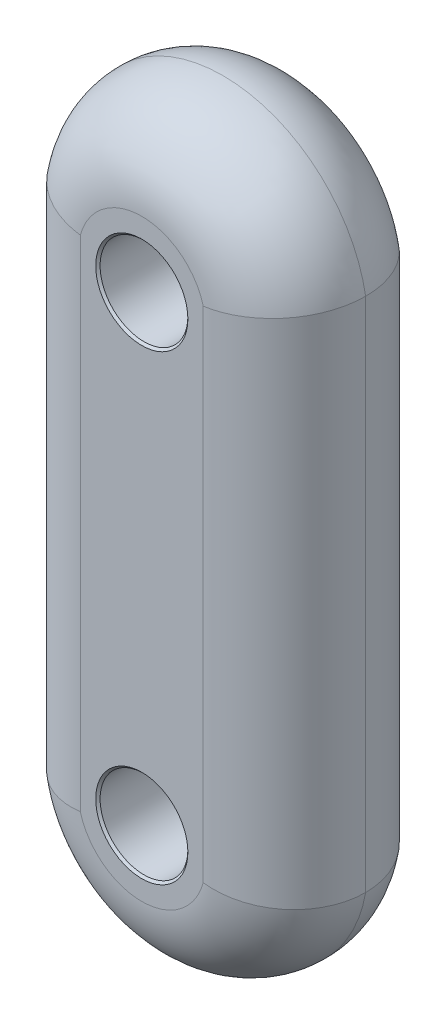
ISO-10303-21;
HEADER;
FILE_DESCRIPTION(('STEP AP214'),'2;1');
FILE_NAME('part.step','',(''),(''),'','','');
FILE_SCHEMA(('AUTOMOTIVE_DESIGN { 1 0 10303 214 1 1 1 1 }'));
ENDSEC;
DATA;
#1=APPLICATION_CONTEXT('core data for automotive mechanical design processes');
#2=APPLICATION_PROTOCOL_DEFINITION('international standard','automotive_design',2000,#1);
#3=PRODUCT_CONTEXT('',#1,'mechanical');
#4=PRODUCT('Part','Part','',(#3));
#5=PRODUCT_RELATED_PRODUCT_CATEGORY('part','',(#4));
#6=PRODUCT_DEFINITION_FORMATION('','',#4);
#7=PRODUCT_DEFINITION_CONTEXT('part definition',#1,'design');
#8=PRODUCT_DEFINITION('design','',#6,#7);
#9=PRODUCT_DEFINITION_SHAPE('','',#8);
#10=(LENGTH_UNIT() NAMED_UNIT(*) SI_UNIT(.MILLI.,.METRE.));
#11=(NAMED_UNIT(*) PLANE_ANGLE_UNIT() SI_UNIT($,.RADIAN.));
#12=(NAMED_UNIT(*) SI_UNIT($,.STERADIAN.) SOLID_ANGLE_UNIT());
#13=UNCERTAINTY_MEASURE_WITH_UNIT(LENGTH_MEASURE(1.E-05),#10,'distance_accuracy_value','');
#14=(GEOMETRIC_REPRESENTATION_CONTEXT(3) GLOBAL_UNCERTAINTY_ASSIGNED_CONTEXT((#13)) GLOBAL_UNIT_ASSIGNED_CONTEXT((#10,
#11,#12)) REPRESENTATION_CONTEXT('',''));
#15=CARTESIAN_POINT('',(0.,0.,0.));
#16=DIRECTION('',(0.,0.,1.));
#17=DIRECTION('',(1.,0.,0.));
#18=AXIS2_PLACEMENT_3D('',#15,#16,#17);
#19=CARTESIAN_POINT('',(0.,53.0945,18.5));
#20=DIRECTION('',(0.,0.,1.));
#21=DIRECTION('',(1.,0.,0.));
#22=AXIS2_PLACEMENT_3D('',#19,#20,#21);
#23=PLANE('',#22);
#24=CARTESIAN_POINT('',(0.,-52.5945,18.5));
#25=DIRECTION('',(0.,0.,1.));
#26=DIRECTION('',(1.,0.,0.));
#27=AXIS2_PLACEMENT_3D('',#24,#25,#26);
#28=CIRCLE('',#27,10.5);
#29=CARTESIAN_POINT('',(10.5,-52.5945,18.5));
#30=VERTEX_POINT('',#29);
#31=EDGE_CURVE('E231',#30,#30,#28,.F.);
#32=ORIENTED_EDGE('',*,*,#31,.T.);
#33=EDGE_LOOP('',(#32));
#34=FACE_BOUND('',#33,.T.);
#35=CARTESIAN_POINT('',(0.,52.5945,18.5));
#36=DIRECTION('',(0.,0.,1.));
#37=DIRECTION('',(1.,0.,0.));
#38=AXIS2_PLACEMENT_3D('',#35,#36,#37);
#39=CIRCLE('',#38,10.5);
#40=CARTESIAN_POINT('',(10.5,52.5945,18.5));
#41=VERTEX_POINT('',#40);
#42=EDGE_CURVE('E226',#41,#41,#39,.F.);
#43=ORIENTED_EDGE('',*,*,#42,.T.);
#44=EDGE_LOOP('',(#43));
#45=FACE_BOUND('',#44,.T.);
#46=CARTESIAN_POINT('',(0.,-53.0945,18.5));
#47=DIRECTION('',(0.,0.,1.));
#48=DIRECTION('',(1.,0.,0.));
#49=AXIS2_PLACEMENT_3D('',#46,#47,#48);
#50=CIRCLE('',#49,14.5);
#51=CARTESIAN_POINT('',(-14.,-56.8694172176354,18.5));
#52=VERTEX_POINT('',#51);
#53=CARTESIAN_POINT('',(14.,-56.8694172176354,18.5));
#54=VERTEX_POINT('',#53);
#55=EDGE_CURVE('E47',#52,#54,#50,.T.);
#56=ORIENTED_EDGE('',*,*,#55,.T.);
#57=DIRECTION('',(0.,1.,0.));
#58=VECTOR('',#57,1.);
#59=CARTESIAN_POINT('',(14.,58.8172615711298,18.5));
#60=LINE('',#59,#58);
#61=CARTESIAN_POINT('',(14.,56.8694172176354,18.5));
#62=VERTEX_POINT('',#61);
#63=EDGE_CURVE('E95',#54,#62,#60,.T.);
#64=ORIENTED_EDGE('',*,*,#63,.T.);
#65=CARTESIAN_POINT('',(0.,53.0945,18.5));
#66=DIRECTION('',(0.,0.,1.));
#67=DIRECTION('',(1.,0.,0.));
#68=AXIS2_PLACEMENT_3D('',#65,#66,#67);
#69=CIRCLE('',#68,14.5);
#70=CARTESIAN_POINT('',(-14.,56.8694172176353,18.5));
#71=VERTEX_POINT('',#70);
#72=EDGE_CURVE('E91',#62,#71,#69,.T.);
#73=ORIENTED_EDGE('',*,*,#72,.T.);
#74=DIRECTION('',(0.,-1.,0.));
#75=VECTOR('',#74,1.);
#76=CARTESIAN_POINT('',(-14.,-58.8172615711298,18.5));
#77=LINE('',#76,#75);
#78=EDGE_CURVE('E94',#71,#52,#77,.T.);
#79=ORIENTED_EDGE('',*,*,#78,.T.);
#80=EDGE_LOOP('',(#56,#64,#73,#79));
#81=FACE_BOUND('',#80,.T.);
#82=ADVANCED_FACE('F30',(#34,#45,#81),#23,.T.);
#83=CARTESIAN_POINT('',(0.,53.0945,-18.5));
#84=DIRECTION('',(0.,0.,1.));
#85=DIRECTION('',(1.,0.,0.));
#86=AXIS2_PLACEMENT_3D('',#83,#84,#85);
#87=PLANE('',#86);
#88=CARTESIAN_POINT('',(0.,-52.5945,-18.5));
#89=DIRECTION('',(0.,0.,1.));
#90=DIRECTION('',(1.,0.,0.));
#91=AXIS2_PLACEMENT_3D('',#88,#89,#90);
#92=CIRCLE('',#91,10.5);
#93=CARTESIAN_POINT('',(10.5,-52.5945,-18.5));
#94=VERTEX_POINT('',#93);
#95=EDGE_CURVE('E236',#94,#94,#92,.T.);
#96=ORIENTED_EDGE('',*,*,#95,.T.);
#97=EDGE_LOOP('',(#96));
#98=FACE_BOUND('',#97,.T.);
#99=CARTESIAN_POINT('',(0.,52.5945,-18.5));
#100=DIRECTION('',(0.,0.,1.));
#101=DIRECTION('',(1.,0.,0.));
#102=AXIS2_PLACEMENT_3D('',#99,#100,#101);
#103=CIRCLE('',#102,10.5);
#104=CARTESIAN_POINT('',(10.5,52.5945,-18.5));
#105=VERTEX_POINT('',#104);
#106=EDGE_CURVE('E233',#105,#105,#103,.T.);
#107=ORIENTED_EDGE('',*,*,#106,.T.);
#108=EDGE_LOOP('',(#107));
#109=FACE_BOUND('',#108,.T.);
#110=CARTESIAN_POINT('',(0.,-53.0945,-18.5));
#111=DIRECTION('',(0.,0.,1.));
#112=DIRECTION('',(1.,0.,0.));
#113=AXIS2_PLACEMENT_3D('',#110,#111,#112);
#114=CIRCLE('',#113,14.5);
#115=CARTESIAN_POINT('',(14.,-56.8694172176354,-18.5));
#116=VERTEX_POINT('',#115);
#117=CARTESIAN_POINT('',(-14.,-56.8694172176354,-18.5));
#118=VERTEX_POINT('',#117);
#119=EDGE_CURVE('E247',#116,#118,#114,.F.);
#120=ORIENTED_EDGE('',*,*,#119,.T.);
#121=DIRECTION('',(0.,-1.,0.));
#122=VECTOR('',#121,1.);
#123=CARTESIAN_POINT('',(-14.,53.0945,-18.5));
#124=LINE('',#123,#122);
#125=CARTESIAN_POINT('',(-14.,56.8694172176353,-18.5));
#126=VERTEX_POINT('',#125);
#127=EDGE_CURVE('E96',#118,#126,#124,.F.);
#128=ORIENTED_EDGE('',*,*,#127,.T.);
#129=CARTESIAN_POINT('',(0.,53.0945,-18.5));
#130=DIRECTION('',(0.,0.,1.));
#131=DIRECTION('',(1.,0.,0.));
#132=AXIS2_PLACEMENT_3D('',#129,#130,#131);
#133=CIRCLE('',#132,14.5);
#134=CARTESIAN_POINT('',(14.,56.8694172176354,-18.5));
#135=VERTEX_POINT('',#134);
#136=EDGE_CURVE('E358',#126,#135,#133,.F.);
#137=ORIENTED_EDGE('',*,*,#136,.T.);
#138=DIRECTION('',(0.,1.,0.));
#139=VECTOR('',#138,1.);
#140=CARTESIAN_POINT('',(14.,53.0945,-18.5));
#141=LINE('',#140,#139);
#142=EDGE_CURVE('E249',#135,#116,#141,.F.);
#143=ORIENTED_EDGE('',*,*,#142,.T.);
#144=EDGE_LOOP('',(#120,#128,#137,#143));
#145=FACE_BOUND('',#144,.T.);
#146=ADVANCED_FACE('F183',(#98,#109,#145),#87,.F.);
#147=CARTESIAN_POINT('',(14.,53.0945,0.));
#148=DIRECTION('',(0.,-1.,0.));
#149=DIRECTION('',(1.,0.,0.));
#150=AXIS2_PLACEMENT_3D('',#147,#148,#149);
#151=CYLINDRICAL_SURFACE('',#150,18.5);
#152=CARTESIAN_POINT('',(32.5,58.8172615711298,0.));
#153=CARTESIAN_POINT('',(32.5000003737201,58.8172614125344,0.259394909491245));
#154=CARTESIAN_POINT('',(32.4945437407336,58.8167848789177,0.518760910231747));
#155=CARTESIAN_POINT('',(32.4727327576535,58.8148788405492,1.03702451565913));
#156=CARTESIAN_POINT('',(32.4563786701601,58.813449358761,1.29592213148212));
#157=CARTESIAN_POINT('',(32.3910057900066,58.8077321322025,2.07117876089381));
#158=CARTESIAN_POINT('',(32.3256763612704,58.8020156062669,2.58623903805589));
#159=CARTESIAN_POINT('',(32.1520434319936,58.7867843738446,3.6085941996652));
#160=CARTESIAN_POINT('',(32.0437733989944,58.7772726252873,4.11589481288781));
#161=CARTESIAN_POINT('',(31.8497903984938,58.7601705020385,4.86848529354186));
#162=CARTESIAN_POINT('',(31.7798628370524,58.7539970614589,5.11796559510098));
#163=CARTESIAN_POINT('',(31.6295846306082,58.7407048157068,5.61381105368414));
#164=CARTESIAN_POINT('',(31.5492313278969,58.7335857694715,5.86017539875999));
#165=CARTESIAN_POINT('',(31.2927168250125,58.7108109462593,6.59396908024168));
#166=CARTESIAN_POINT('',(31.101114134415,58.6937386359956,7.07604824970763));
#167=CARTESIAN_POINT('',(30.6781702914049,58.6558423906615,8.0222941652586));
#168=CARTESIAN_POINT('',(30.4468290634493,58.6350184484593,8.48646087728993));
#169=CARTESIAN_POINT('',(30.0713589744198,58.6009949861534,9.166709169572));
#170=CARTESIAN_POINT('',(29.941448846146,58.58918828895,9.39080721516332));
#171=CARTESIAN_POINT('',(29.6723973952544,58.5646506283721,9.83325910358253));
#172=CARTESIAN_POINT('',(29.5332584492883,58.551919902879,10.0516144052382));
#173=CARTESIAN_POINT('',(29.1022885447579,58.5123395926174,10.6976056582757));
#174=CARTESIAN_POINT('',(28.7968800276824,58.4840996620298,11.1162113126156));
#175=CARTESIAN_POINT('',(28.1518051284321,58.423919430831,11.9266537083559));
#176=CARTESIAN_POINT('',(27.8120951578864,58.3919744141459,12.3184553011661));
#177=CARTESIAN_POINT('',(27.1011731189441,58.3244439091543,13.0720151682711));
#178=CARTESIAN_POINT('',(26.7299608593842,58.2888583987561,13.4337732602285));
#179=CARTESIAN_POINT('',(25.9585418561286,58.214064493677,14.1248521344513));
#180=CARTESIAN_POINT('',(25.558326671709,58.1748550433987,14.4541634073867));
#181=CARTESIAN_POINT('',(24.9386683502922,58.1133731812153,14.9218822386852));
#182=CARTESIAN_POINT('',(24.7288843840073,58.0924337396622,15.0734192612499));
#183=CARTESIAN_POINT('',(24.3031537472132,58.0496600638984,15.3675625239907));
#184=CARTESIAN_POINT('',(24.0872055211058,58.0278256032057,15.5101664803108));
#185=CARTESIAN_POINT('',(23.4292619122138,57.9608396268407,15.9250880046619));
#186=CARTESIAN_POINT('',(22.9785255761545,57.9143397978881,16.1834903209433));
#187=CARTESIAN_POINT('',(22.0572254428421,57.8177992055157,16.6613446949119));
#188=CARTESIAN_POINT('',(21.5866616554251,57.7677584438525,16.8807967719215));
#189=CARTESIAN_POINT('',(20.868687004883,57.6900801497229,17.1795913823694));
#190=CARTESIAN_POINT('',(20.6273611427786,57.6637534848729,17.274119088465));
#191=CARTESIAN_POINT('',(20.1411023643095,57.610230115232,17.4529069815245));
#192=CARTESIAN_POINT('',(19.8961703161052,57.5830336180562,17.5371695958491));
#193=CARTESIAN_POINT('',(19.1565912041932,57.5001378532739,17.7743477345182));
#194=CARTESIAN_POINT('',(18.6569845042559,57.4431132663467,17.9117270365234));
#195=CARTESIAN_POINT('',(17.8162756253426,57.3451251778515,18.1053982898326));
#196=CARTESIAN_POINT('',(17.4776980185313,57.3051248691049,18.1734640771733));
#197=CARTESIAN_POINT('',(16.7974413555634,57.2235561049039,18.2905267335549));
#198=CARTESIAN_POINT('',(16.4557625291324,57.1819877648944,18.3395250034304));
#199=CARTESIAN_POINT('',(15.7709511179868,57.0973414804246,18.4182618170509));
#200=CARTESIAN_POINT('',(15.4278216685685,57.0542660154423,18.4480305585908));
#201=CARTESIAN_POINT('',(14.7406958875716,56.9665304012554,18.4883679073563));
#202=CARTESIAN_POINT('',(14.3966998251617,56.9218706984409,18.4989418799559));
#203=CARTESIAN_POINT('',(14.0352354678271,56.8740821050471,18.4999748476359));
#204=CARTESIAN_POINT('',(14.0176174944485,56.8717507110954,18.5000000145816));
#205=CARTESIAN_POINT('',(14.,56.8694172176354,18.5));
#206=B_SPLINE_CURVE_WITH_KNOTS('',3,(#152,#153,#154,#155,#156,#157,#158,#159,#160,#161,#162,
#163,#164,#165,#166,#167,#168,#169,#170,#171,#172,#173,#174,#175,#176,#177,#178,#179,#180,#181,
#182,#183,#184,#185,#186,#187,#188,#189,#190,#191,#192,#193,#194,#195,#196,#197,#198,#199,#200,
#201,#202,#203,#204,#205),.UNSPECIFIED.,.F.,.F.,(4,2,2,2,2,2,2,2,2,2,2,2,2,2,2,2,2,2,2,2,2,2,2,
2,2,2,4),(0.,0.778069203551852,1.55611965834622,3.11180946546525,4.66628915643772,
5.44359374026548,6.22109686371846,7.7762600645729,9.33142622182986,10.1091214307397,
10.8866171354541,12.4414568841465,13.9982979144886,15.5551483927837,17.1124537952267,
17.8911675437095,18.6700795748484,20.2330070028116,21.7959336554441,22.5772673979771,
23.3584160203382,24.9201381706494,25.9626534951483,27.005092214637,28.0458898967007,
29.0863966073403,29.139711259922),.UNSPECIFIED.);
#207=CARTESIAN_POINT('',(32.5,58.8172615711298,0.));
#208=VERTEX_POINT('',#207);
#209=EDGE_CURVE('E70',#62,#208,#206,.F.);
#210=ORIENTED_EDGE('',*,*,#209,.F.);
#211=ORIENTED_EDGE('',*,*,#63,.F.);
#212=CARTESIAN_POINT('',(32.5,-58.8172615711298,0.));
#213=CARTESIAN_POINT('',(32.5000003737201,-58.8172614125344,0.259394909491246));
#214=CARTESIAN_POINT('',(32.4945437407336,-58.8167848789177,0.518760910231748));
#215=CARTESIAN_POINT('',(32.4727327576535,-58.8148788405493,1.03702451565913));
#216=CARTESIAN_POINT('',(32.4563786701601,-58.8134493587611,1.29592213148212));
#217=CARTESIAN_POINT('',(32.3910057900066,-58.8077321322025,2.07117876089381));
#218=CARTESIAN_POINT('',(32.3256763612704,-58.802015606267,2.5862390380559));
#219=CARTESIAN_POINT('',(32.1520434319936,-58.7867843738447,3.60859419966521));
#220=CARTESIAN_POINT('',(32.0437733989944,-58.7772726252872,4.11589481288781));
#221=CARTESIAN_POINT('',(31.8497903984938,-58.7601705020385,4.86848529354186));
#222=CARTESIAN_POINT('',(31.7798628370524,-58.7539970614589,5.11796559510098));
#223=CARTESIAN_POINT('',(31.6295846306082,-58.7407048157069,5.61381105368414));
#224=CARTESIAN_POINT('',(31.5492313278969,-58.7335857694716,5.86017539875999));
#225=CARTESIAN_POINT('',(31.2927168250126,-58.7108109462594,6.59396908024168));
#226=CARTESIAN_POINT('',(31.101114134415,-58.6937386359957,7.07604824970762));
#227=CARTESIAN_POINT('',(30.6781702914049,-58.6558423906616,8.02229416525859));
#228=CARTESIAN_POINT('',(30.4468290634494,-58.6350184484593,8.48646087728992));
#229=CARTESIAN_POINT('',(30.0713589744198,-58.6009949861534,9.16670916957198));
#230=CARTESIAN_POINT('',(29.9414488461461,-58.5891882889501,9.39080721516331));
#231=CARTESIAN_POINT('',(29.6723973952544,-58.5646506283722,9.83325910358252));
#232=CARTESIAN_POINT('',(29.5332584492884,-58.551919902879,10.0516144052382));
#233=CARTESIAN_POINT('',(29.1022885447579,-58.5123395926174,10.6976056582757));
#234=CARTESIAN_POINT('',(28.7968800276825,-58.4840996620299,11.1162113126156));
#235=CARTESIAN_POINT('',(28.1518051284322,-58.423919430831,11.9266537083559));
#236=CARTESIAN_POINT('',(27.8120951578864,-58.391974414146,12.3184553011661));
#237=CARTESIAN_POINT('',(27.101173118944,-58.3244439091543,13.0720151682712));
#238=CARTESIAN_POINT('',(26.7299608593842,-58.2888583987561,13.4337732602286));
#239=CARTESIAN_POINT('',(25.9585418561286,-58.214064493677,14.1248521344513));
#240=CARTESIAN_POINT('',(25.558326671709,-58.1748550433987,14.4541634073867));
#241=CARTESIAN_POINT('',(24.9386683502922,-58.1133731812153,14.9218822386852));
#242=CARTESIAN_POINT('',(24.7288843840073,-58.0924337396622,15.0734192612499));
#243=CARTESIAN_POINT('',(24.3031537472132,-58.0496600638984,15.3675625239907));
#244=CARTESIAN_POINT('',(24.0872055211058,-58.0278256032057,15.5101664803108));
#245=CARTESIAN_POINT('',(23.4292619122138,-57.9608396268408,15.9250880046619));
#246=CARTESIAN_POINT('',(22.9785255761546,-57.9143397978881,16.1834903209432));
#247=CARTESIAN_POINT('',(22.0572254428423,-57.8177992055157,16.6613446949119));
#248=CARTESIAN_POINT('',(21.5866616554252,-57.7677584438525,16.8807967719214));
#249=CARTESIAN_POINT('',(20.8686870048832,-57.690080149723,17.1795913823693));
#250=CARTESIAN_POINT('',(20.6273611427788,-57.663753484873,17.274119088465));
#251=CARTESIAN_POINT('',(20.1411023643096,-57.610230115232,17.4529069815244));
#252=CARTESIAN_POINT('',(19.8961703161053,-57.5830336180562,17.537169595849));
#253=CARTESIAN_POINT('',(19.1565912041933,-57.5001378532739,17.7743477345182));
#254=CARTESIAN_POINT('',(18.656984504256,-57.4431132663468,17.9117270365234));
#255=CARTESIAN_POINT('',(17.8162756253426,-57.3451251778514,18.1053982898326));
#256=CARTESIAN_POINT('',(17.4776980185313,-57.3051248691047,18.1734640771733));
#257=CARTESIAN_POINT('',(16.7974413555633,-57.2235561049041,18.2905267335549));
#258=CARTESIAN_POINT('',(16.4557625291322,-57.1819877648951,18.3395250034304));
#259=CARTESIAN_POINT('',(15.7709511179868,-57.0973414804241,18.4182618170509));
#260=CARTESIAN_POINT('',(15.4278216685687,-57.0542660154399,18.4480305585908));
#261=CARTESIAN_POINT('',(14.7406958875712,-56.9665304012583,18.4883679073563));
#262=CARTESIAN_POINT('',(14.3966998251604,-56.9218706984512,18.4989418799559));
#263=CARTESIAN_POINT('',(14.035235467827,-56.8740821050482,18.4999748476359));
#264=CARTESIAN_POINT('',(14.0176174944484,-56.8717507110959,18.5000000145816));
#265=CARTESIAN_POINT('',(14.,-56.8694172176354,18.5));
#266=B_SPLINE_CURVE_WITH_KNOTS('',3,(#212,#213,#214,#215,#216,#217,#218,#219,#220,#221,#222,
#223,#224,#225,#226,#227,#228,#229,#230,#231,#232,#233,#234,#235,#236,#237,#238,#239,#240,#241,
#242,#243,#244,#245,#246,#247,#248,#249,#250,#251,#252,#253,#254,#255,#256,#257,#258,#259,#260,
#261,#262,#263,#264,#265),.UNSPECIFIED.,.F.,.F.,(4,2,2,2,2,2,2,2,2,2,2,2,2,2,2,2,2,2,2,2,2,2,2,
2,2,2,4),(0.,0.778069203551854,1.55611965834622,3.11180946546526,4.66628915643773,
5.44359374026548,6.22109686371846,7.77626006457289,9.33142622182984,10.1091214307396,
10.8866171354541,12.4414568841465,13.9982979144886,15.5551483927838,17.1124537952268,
17.8911675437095,18.6700795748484,20.2330070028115,21.7959336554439,22.577267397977,
23.3584160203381,24.9201381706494,25.9626534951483,27.0050922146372,28.0458898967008,
29.0863966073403,29.139711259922),.UNSPECIFIED.);
#267=CARTESIAN_POINT('',(32.5,-58.8172615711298,0.));
#268=VERTEX_POINT('',#267);
#269=EDGE_CURVE('E63',#268,#54,#266,.T.);
#270=ORIENTED_EDGE('',*,*,#269,.F.);
#271=DIRECTION('',(0.,1.,0.));
#272=VECTOR('',#271,1.);
#273=CARTESIAN_POINT('',(32.5,-58.8172615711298,0.));
#274=LINE('',#273,#272);
#275=EDGE_CURVE('E166',#208,#268,#274,.F.);
#276=ORIENTED_EDGE('',*,*,#275,.F.);
#277=EDGE_LOOP('',(#210,#211,#270,#276));
#278=FACE_BOUND('',#277,.T.);
#279=ADVANCED_FACE('F179',(#278),#151,.T.);
#280=CARTESIAN_POINT('',(0.,53.0945,0.));
#281=DIRECTION('',(0.,0.,1.));
#282=DIRECTION('',(1.,0.,0.));
#283=AXIS2_PLACEMENT_3D('',#280,#281,#282);
#284=DEGENERATE_TOROIDAL_SURFACE('',#283,14.5,18.5,.T.);
#285=ORIENTED_EDGE('',*,*,#72,.F.);
#286=ORIENTED_EDGE('',*,*,#209,.T.);
#287=CARTESIAN_POINT('',(0.,53.0945,0.));
#288=DIRECTION('',(0.,0.,1.));
#289=DIRECTION('',(1.,0.,0.));
#290=AXIS2_PLACEMENT_3D('',#287,#288,#289);
#291=CIRCLE('',#290,33.);
#292=CARTESIAN_POINT('',(-32.5,58.8172615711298,0.));
#293=VERTEX_POINT('',#292);
#294=EDGE_CURVE('E102',#293,#208,#291,.F.);
#295=ORIENTED_EDGE('',*,*,#294,.F.);
#296=CARTESIAN_POINT('',(-32.5,58.8172615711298,0.));
#297=CARTESIAN_POINT('',(-32.5000003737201,58.8172614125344,0.259394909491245));
#298=CARTESIAN_POINT('',(-32.4945437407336,58.8167848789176,0.518760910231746));
#299=CARTESIAN_POINT('',(-32.4727327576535,58.8148788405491,1.03702451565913));
#300=CARTESIAN_POINT('',(-32.4563786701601,58.8134493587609,1.29592213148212));
#301=CARTESIAN_POINT('',(-32.3910057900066,58.8077321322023,2.07117876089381));
#302=CARTESIAN_POINT('',(-32.3256763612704,58.8020156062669,2.5862390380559));
#303=CARTESIAN_POINT('',(-32.1520434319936,58.7867843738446,3.6085941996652));
#304=CARTESIAN_POINT('',(-32.0437733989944,58.7772726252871,4.11589481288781));
#305=CARTESIAN_POINT('',(-31.8497903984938,58.7601705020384,4.86848529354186));
#306=CARTESIAN_POINT('',(-31.7798628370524,58.7539970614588,5.11796559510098));
#307=CARTESIAN_POINT('',(-31.6295846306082,58.7407048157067,5.61381105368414));
#308=CARTESIAN_POINT('',(-31.5492313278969,58.7335857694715,5.86017539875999));
#309=CARTESIAN_POINT('',(-31.2927168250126,58.7108109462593,6.59396908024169));
#310=CARTESIAN_POINT('',(-31.101114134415,58.6937386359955,7.07604824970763));
#311=CARTESIAN_POINT('',(-30.6781702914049,58.6558423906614,8.0222941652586));
#312=CARTESIAN_POINT('',(-30.4468290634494,58.6350184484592,8.48646087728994));
#313=CARTESIAN_POINT('',(-30.0713589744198,58.6009949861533,9.166709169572));
#314=CARTESIAN_POINT('',(-29.9414488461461,58.5891882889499,9.39080721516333));
#315=CARTESIAN_POINT('',(-29.6723973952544,58.564650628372,9.83325910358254));
#316=CARTESIAN_POINT('',(-29.5332584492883,58.5519199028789,10.0516144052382));
#317=CARTESIAN_POINT('',(-29.1022885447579,58.5123395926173,10.6976056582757));
#318=CARTESIAN_POINT('',(-28.7968800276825,58.4840996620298,11.1162113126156));
#319=CARTESIAN_POINT('',(-28.1518051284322,58.4239194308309,11.9266537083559));
#320=CARTESIAN_POINT('',(-27.8120951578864,58.3919744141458,12.3184553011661));
#321=CARTESIAN_POINT('',(-27.1011731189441,58.3244439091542,13.0720151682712));
#322=CARTESIAN_POINT('',(-26.7299608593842,58.2888583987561,13.4337732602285));
#323=CARTESIAN_POINT('',(-25.9585418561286,58.2140644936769,14.1248521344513));
#324=CARTESIAN_POINT('',(-25.558326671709,58.1748550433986,14.4541634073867));
#325=CARTESIAN_POINT('',(-24.9386683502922,58.1133731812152,14.9218822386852));
#326=CARTESIAN_POINT('',(-24.7288843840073,58.0924337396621,15.0734192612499));
#327=CARTESIAN_POINT('',(-24.3031537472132,58.0496600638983,15.3675625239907));
#328=CARTESIAN_POINT('',(-24.0872055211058,58.0278256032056,15.5101664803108));
#329=CARTESIAN_POINT('',(-23.4292619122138,57.9608396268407,15.9250880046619));
#330=CARTESIAN_POINT('',(-22.9785255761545,57.914339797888,16.1834903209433));
#331=CARTESIAN_POINT('',(-22.0572254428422,57.8177992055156,16.661344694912));
#332=CARTESIAN_POINT('',(-21.5866616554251,57.7677584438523,16.8807967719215));
#333=CARTESIAN_POINT('',(-20.868687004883,57.6900801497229,17.1795913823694));
#334=CARTESIAN_POINT('',(-20.6273611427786,57.6637534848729,17.274119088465));
#335=CARTESIAN_POINT('',(-20.1411023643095,57.610230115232,17.4529069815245));
#336=CARTESIAN_POINT('',(-19.8961703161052,57.5830336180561,17.5371695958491));
#337=CARTESIAN_POINT('',(-19.1565912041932,57.5001378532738,17.7743477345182));
#338=CARTESIAN_POINT('',(-18.6569845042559,57.4431132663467,17.9117270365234));
#339=CARTESIAN_POINT('',(-17.8162756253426,57.3451251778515,18.1053982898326));
#340=CARTESIAN_POINT('',(-17.4776980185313,57.3051248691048,18.1734640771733));
#341=CARTESIAN_POINT('',(-16.7974413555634,57.2235561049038,18.2905267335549));
#342=CARTESIAN_POINT('',(-16.4557625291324,57.1819877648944,18.3395250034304));
#343=CARTESIAN_POINT('',(-15.7709511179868,57.0973414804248,18.4182618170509));
#344=CARTESIAN_POINT('',(-15.4278216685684,57.0542660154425,18.4480305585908));
#345=CARTESIAN_POINT('',(-14.7406958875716,56.9665304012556,18.4883679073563));
#346=CARTESIAN_POINT('',(-14.3966998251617,56.921870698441,18.4989418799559));
#347=CARTESIAN_POINT('',(-14.0352354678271,56.8740821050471,18.4999748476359));
#348=CARTESIAN_POINT('',(-14.0176174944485,56.8717507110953,18.5000000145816));
#349=CARTESIAN_POINT('',(-14.,56.8694172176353,18.5));
#350=B_SPLINE_CURVE_WITH_KNOTS('',3,(#296,#297,#298,#299,#300,#301,#302,#303,#304,#305,#306,
#307,#308,#309,#310,#311,#312,#313,#314,#315,#316,#317,#318,#319,#320,#321,#322,#323,#324,#325,
#326,#327,#328,#329,#330,#331,#332,#333,#334,#335,#336,#337,#338,#339,#340,#341,#342,#343,#344,
#345,#346,#347,#348,#349),.UNSPECIFIED.,.F.,.F.,(4,2,2,2,2,2,2,2,2,2,2,2,2,2,2,2,2,2,2,2,2,2,2,
2,2,2,4),(0.,0.778069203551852,1.55611965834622,3.11180946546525,4.66628915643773,
5.44359374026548,6.22109686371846,7.77626006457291,9.33142622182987,10.1091214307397,
10.8866171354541,12.4414568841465,13.9982979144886,15.5551483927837,17.1124537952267,
17.8911675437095,18.6700795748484,20.2330070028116,21.7959336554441,22.5772673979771,
23.3584160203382,24.9201381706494,25.9626534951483,27.005092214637,28.0458898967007,
29.0863966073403,29.139711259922),.UNSPECIFIED.);
#351=EDGE_CURVE('E99',#71,#293,#350,.F.);
#352=ORIENTED_EDGE('',*,*,#351,.F.);
#353=EDGE_LOOP('',(#285,#286,#295,#352));
#354=FACE_BOUND('',#353,.T.);
#355=ADVANCED_FACE('F100',(#354),#284,.T.);
#356=CARTESIAN_POINT('',(0.,-53.0945,0.));
#357=DIRECTION('',(0.,0.,1.));
#358=DIRECTION('',(1.,0.,0.));
#359=AXIS2_PLACEMENT_3D('',#356,#357,#358);
#360=DEGENERATE_TOROIDAL_SURFACE('',#359,14.5,18.5,.T.);
#361=ORIENTED_EDGE('',*,*,#269,.T.);
#362=ORIENTED_EDGE('',*,*,#55,.F.);
#363=CARTESIAN_POINT('',(-32.5,-58.8172615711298,0.));
#364=CARTESIAN_POINT('',(-32.5000003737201,-58.8172614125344,0.259394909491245));
#365=CARTESIAN_POINT('',(-32.4945437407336,-58.8167848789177,0.518760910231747));
#366=CARTESIAN_POINT('',(-32.4727327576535,-58.8148788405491,1.03702451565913));
#367=CARTESIAN_POINT('',(-32.4563786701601,-58.813449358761,1.29592213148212));
#368=CARTESIAN_POINT('',(-32.3910057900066,-58.8077321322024,2.07117876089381));
#369=CARTESIAN_POINT('',(-32.3256763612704,-58.8020156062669,2.5862390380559));
#370=CARTESIAN_POINT('',(-32.1520434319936,-58.7867843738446,3.6085941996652));
#371=CARTESIAN_POINT('',(-32.0437733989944,-58.7772726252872,4.11589481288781));
#372=CARTESIAN_POINT('',(-31.8497903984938,-58.7601705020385,4.86848529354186));
#373=CARTESIAN_POINT('',(-31.7798628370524,-58.7539970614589,5.11796559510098));
#374=CARTESIAN_POINT('',(-31.6295846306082,-58.7407048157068,5.61381105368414));
#375=CARTESIAN_POINT('',(-31.5492313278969,-58.7335857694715,5.86017539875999));
#376=CARTESIAN_POINT('',(-31.2927168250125,-58.7108109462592,6.59396908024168));
#377=CARTESIAN_POINT('',(-31.101114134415,-58.6937386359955,7.07604824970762));
#378=CARTESIAN_POINT('',(-30.6781702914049,-58.6558423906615,8.02229416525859));
#379=CARTESIAN_POINT('',(-30.4468290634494,-58.6350184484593,8.48646087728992));
#380=CARTESIAN_POINT('',(-30.0713589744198,-58.6009949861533,9.16670916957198));
#381=CARTESIAN_POINT('',(-29.9414488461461,-58.58918828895,9.39080721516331));
#382=CARTESIAN_POINT('',(-29.6723973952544,-58.5646506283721,9.83325910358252));
#383=CARTESIAN_POINT('',(-29.5332584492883,-58.5519199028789,10.0516144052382));
#384=CARTESIAN_POINT('',(-29.1022885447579,-58.5123395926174,10.6976056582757));
#385=CARTESIAN_POINT('',(-28.7968800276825,-58.4840996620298,11.1162113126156));
#386=CARTESIAN_POINT('',(-28.1518051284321,-58.423919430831,11.9266537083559));
#387=CARTESIAN_POINT('',(-27.8120951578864,-58.3919744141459,12.3184553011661));
#388=CARTESIAN_POINT('',(-27.101173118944,-58.3244439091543,13.0720151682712));
#389=CARTESIAN_POINT('',(-26.7299608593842,-58.2888583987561,13.4337732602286));
#390=CARTESIAN_POINT('',(-25.9585418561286,-58.2140644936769,14.1248521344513));
#391=CARTESIAN_POINT('',(-25.558326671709,-58.1748550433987,14.4541634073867));
#392=CARTESIAN_POINT('',(-24.9386683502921,-58.1133731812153,14.9218822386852));
#393=CARTESIAN_POINT('',(-24.7288843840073,-58.0924337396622,15.0734192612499));
#394=CARTESIAN_POINT('',(-24.3031537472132,-58.0496600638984,15.3675625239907));
#395=CARTESIAN_POINT('',(-24.0872055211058,-58.0278256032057,15.5101664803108));
#396=CARTESIAN_POINT('',(-23.4292619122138,-57.9608396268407,15.9250880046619));
#397=CARTESIAN_POINT('',(-22.9785255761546,-57.914339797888,16.1834903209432));
#398=CARTESIAN_POINT('',(-22.0572254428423,-57.8177992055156,16.6613446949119));
#399=CARTESIAN_POINT('',(-21.5866616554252,-57.7677584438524,16.8807967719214));
#400=CARTESIAN_POINT('',(-20.8686870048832,-57.6900801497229,17.1795913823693));
#401=CARTESIAN_POINT('',(-20.6273611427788,-57.6637534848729,17.274119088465));
#402=CARTESIAN_POINT('',(-20.1411023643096,-57.610230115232,17.4529069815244));
#403=CARTESIAN_POINT('',(-19.8961703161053,-57.5830336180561,17.537169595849));
#404=CARTESIAN_POINT('',(-19.1565912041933,-57.5001378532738,17.7743477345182));
#405=CARTESIAN_POINT('',(-18.6569845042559,-57.4431132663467,17.9117270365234));
#406=CARTESIAN_POINT('',(-17.8162756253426,-57.3451251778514,18.1053982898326));
#407=CARTESIAN_POINT('',(-17.4776980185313,-57.3051248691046,18.1734640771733));
#408=CARTESIAN_POINT('',(-16.7974413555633,-57.223556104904,18.2905267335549));
#409=CARTESIAN_POINT('',(-16.4557625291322,-57.181987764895,18.3395250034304));
#410=CARTESIAN_POINT('',(-15.7709511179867,-57.097341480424,18.4182618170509));
#411=CARTESIAN_POINT('',(-15.4278216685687,-57.0542660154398,18.4480305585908));
#412=CARTESIAN_POINT('',(-14.7406958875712,-56.9665304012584,18.4883679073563));
#413=CARTESIAN_POINT('',(-14.3966998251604,-56.9218706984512,18.4989418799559));
#414=CARTESIAN_POINT('',(-14.035235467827,-56.8740821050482,18.4999748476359));
#415=CARTESIAN_POINT('',(-14.0176174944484,-56.8717507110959,18.5000000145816));
#416=CARTESIAN_POINT('',(-14.,-56.8694172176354,18.5));
#417=B_SPLINE_CURVE_WITH_KNOTS('',3,(#363,#364,#365,#366,#367,#368,#369,#370,#371,#372,#373,
#374,#375,#376,#377,#378,#379,#380,#381,#382,#383,#384,#385,#386,#387,#388,#389,#390,#391,#392,
#393,#394,#395,#396,#397,#398,#399,#400,#401,#402,#403,#404,#405,#406,#407,#408,#409,#410,#411,
#412,#413,#414,#415,#416),.UNSPECIFIED.,.F.,.F.,(4,2,2,2,2,2,2,2,2,2,2,2,2,2,2,2,2,2,2,2,2,2,2,
2,2,2,4),(0.,0.778069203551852,1.55611965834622,3.11180946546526,4.66628915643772,
5.44359374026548,6.22109686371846,7.77626006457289,9.33142622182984,10.1091214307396,
10.8866171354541,12.4414568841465,13.9982979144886,15.5551483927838,17.1124537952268,
17.8911675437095,18.6700795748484,20.2330070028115,21.7959336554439,22.577267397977,
23.3584160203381,24.9201381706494,25.9626534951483,27.0050922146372,28.0458898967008,
29.0863966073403,29.139711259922),.UNSPECIFIED.);
#418=CARTESIAN_POINT('',(-32.5,-58.8172615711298,0.));
#419=VERTEX_POINT('',#418);
#420=EDGE_CURVE('E105',#419,#52,#417,.T.);
#421=ORIENTED_EDGE('',*,*,#420,.F.);
#422=CARTESIAN_POINT('',(0.,-53.0945,0.));
#423=DIRECTION('',(0.,0.,1.));
#424=DIRECTION('',(1.,0.,0.));
#425=AXIS2_PLACEMENT_3D('',#422,#423,#424);
#426=CIRCLE('',#425,33.);
#427=EDGE_CURVE('E147',#268,#419,#426,.F.);
#428=ORIENTED_EDGE('',*,*,#427,.F.);
#429=EDGE_LOOP('',(#361,#362,#421,#428));
#430=FACE_BOUND('',#429,.T.);
#431=ADVANCED_FACE('F153',(#430),#360,.T.);
#432=CARTESIAN_POINT('',(14.,58.8172615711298,0.));
#433=DIRECTION('',(0.,1.,0.));
#434=DIRECTION('',(-1.,0.,0.));
#435=AXIS2_PLACEMENT_3D('',#432,#433,#434);
#436=CYLINDRICAL_SURFACE('',#435,18.5);
#437=CARTESIAN_POINT('',(32.5,-58.8172615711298,0.));
#438=CARTESIAN_POINT('',(32.5000003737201,-58.8172614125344,-0.259394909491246));
#439=CARTESIAN_POINT('',(32.4945437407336,-58.8167848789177,-0.518760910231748));
#440=CARTESIAN_POINT('',(32.4727327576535,-58.8148788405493,-1.03702451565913));
#441=CARTESIAN_POINT('',(32.4563786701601,-58.8134493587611,-1.29592213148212));
#442=CARTESIAN_POINT('',(32.3910057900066,-58.8077321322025,-2.07117876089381));
#443=CARTESIAN_POINT('',(32.3256763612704,-58.802015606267,-2.5862390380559));
#444=CARTESIAN_POINT('',(32.1520434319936,-58.7867843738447,-3.60859419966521));
#445=CARTESIAN_POINT('',(32.0437733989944,-58.7772726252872,-4.11589481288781));
#446=CARTESIAN_POINT('',(31.8497903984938,-58.7601705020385,-4.86848529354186));
#447=CARTESIAN_POINT('',(31.7798628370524,-58.7539970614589,-5.11796559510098));
#448=CARTESIAN_POINT('',(31.6295846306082,-58.7407048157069,-5.61381105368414));
#449=CARTESIAN_POINT('',(31.5492313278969,-58.7335857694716,-5.86017539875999));
#450=CARTESIAN_POINT('',(31.2927168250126,-58.7108109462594,-6.59396908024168));
#451=CARTESIAN_POINT('',(31.101114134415,-58.6937386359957,-7.07604824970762));
#452=CARTESIAN_POINT('',(30.6781702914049,-58.6558423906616,-8.02229416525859));
#453=CARTESIAN_POINT('',(30.4468290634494,-58.6350184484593,-8.48646087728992));
#454=CARTESIAN_POINT('',(30.0713589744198,-58.6009949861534,-9.16670916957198));
#455=CARTESIAN_POINT('',(29.9414488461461,-58.5891882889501,-9.39080721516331));
#456=CARTESIAN_POINT('',(29.6723973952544,-58.5646506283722,-9.83325910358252));
#457=CARTESIAN_POINT('',(29.5332584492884,-58.551919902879,-10.0516144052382));
#458=CARTESIAN_POINT('',(29.1022885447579,-58.5123395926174,-10.6976056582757));
#459=CARTESIAN_POINT('',(28.7968800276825,-58.4840996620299,-11.1162113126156));
#460=CARTESIAN_POINT('',(28.1518051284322,-58.423919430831,-11.9266537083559));
#461=CARTESIAN_POINT('',(27.8120951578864,-58.391974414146,-12.3184553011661));
#462=CARTESIAN_POINT('',(27.101173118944,-58.3244439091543,-13.0720151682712));
#463=CARTESIAN_POINT('',(26.7299608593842,-58.2888583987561,-13.4337732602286));
#464=CARTESIAN_POINT('',(25.9585418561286,-58.214064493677,-14.1248521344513));
#465=CARTESIAN_POINT('',(25.558326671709,-58.1748550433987,-14.4541634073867));
#466=CARTESIAN_POINT('',(24.9386683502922,-58.1133731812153,-14.9218822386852));
#467=CARTESIAN_POINT('',(24.7288843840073,-58.0924337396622,-15.0734192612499));
#468=CARTESIAN_POINT('',(24.3031537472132,-58.0496600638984,-15.3675625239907));
#469=CARTESIAN_POINT('',(24.0872055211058,-58.0278256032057,-15.5101664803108));
#470=CARTESIAN_POINT('',(23.4292619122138,-57.9608396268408,-15.9250880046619));
#471=CARTESIAN_POINT('',(22.9785255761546,-57.9143397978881,-16.1834903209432));
#472=CARTESIAN_POINT('',(22.0572254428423,-57.8177992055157,-16.6613446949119));
#473=CARTESIAN_POINT('',(21.5866616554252,-57.7677584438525,-16.8807967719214));
#474=CARTESIAN_POINT('',(20.8686870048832,-57.690080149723,-17.1795913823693));
#475=CARTESIAN_POINT('',(20.6273611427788,-57.663753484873,-17.274119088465));
#476=CARTESIAN_POINT('',(20.1411023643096,-57.610230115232,-17.4529069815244));
#477=CARTESIAN_POINT('',(19.8961703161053,-57.5830336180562,-17.537169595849));
#478=CARTESIAN_POINT('',(19.1565912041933,-57.5001378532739,-17.7743477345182));
#479=CARTESIAN_POINT('',(18.656984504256,-57.4431132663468,-17.9117270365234));
#480=CARTESIAN_POINT('',(17.8162756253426,-57.3451251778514,-18.1053982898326));
#481=CARTESIAN_POINT('',(17.4776980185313,-57.3051248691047,-18.1734640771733));
#482=CARTESIAN_POINT('',(16.7974413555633,-57.2235561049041,-18.2905267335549));
#483=CARTESIAN_POINT('',(16.4557625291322,-57.1819877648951,-18.3395250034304));
#484=CARTESIAN_POINT('',(15.7709511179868,-57.0973414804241,-18.4182618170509));
#485=CARTESIAN_POINT('',(15.4278216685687,-57.0542660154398,-18.4480305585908));
#486=CARTESIAN_POINT('',(14.7406958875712,-56.9665304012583,-18.4883679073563));
#487=CARTESIAN_POINT('',(14.3966998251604,-56.9218706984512,-18.4989418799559));
#488=CARTESIAN_POINT('',(14.035235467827,-56.8740821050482,-18.4999748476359));
#489=CARTESIAN_POINT('',(14.0176174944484,-56.8717507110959,-18.5000000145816));
#490=CARTESIAN_POINT('',(14.,-56.8694172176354,-18.5));
#491=B_SPLINE_CURVE_WITH_KNOTS('',3,(#437,#438,#439,#440,#441,#442,#443,#444,#445,#446,#447,
#448,#449,#450,#451,#452,#453,#454,#455,#456,#457,#458,#459,#460,#461,#462,#463,#464,#465,#466,
#467,#468,#469,#470,#471,#472,#473,#474,#475,#476,#477,#478,#479,#480,#481,#482,#483,#484,#485,
#486,#487,#488,#489,#490),.UNSPECIFIED.,.F.,.F.,(4,2,2,2,2,2,2,2,2,2,2,2,2,2,2,2,2,2,2,2,2,2,2,
2,2,2,4),(0.,0.778069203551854,1.55611965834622,3.11180946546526,4.66628915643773,
5.44359374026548,6.22109686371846,7.77626006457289,9.33142622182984,10.1091214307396,
10.8866171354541,12.4414568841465,13.9982979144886,15.5551483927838,17.1124537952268,
17.8911675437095,18.6700795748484,20.2330070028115,21.7959336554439,22.577267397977,
23.3584160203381,24.9201381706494,25.9626534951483,27.0050922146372,28.0458898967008,
29.0863966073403,29.139711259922),.UNSPECIFIED.);
#492=EDGE_CURVE('E141',#116,#268,#491,.F.);
#493=ORIENTED_EDGE('',*,*,#492,.F.);
#494=ORIENTED_EDGE('',*,*,#142,.F.);
#495=CARTESIAN_POINT('',(32.5,58.8172615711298,0.));
#496=CARTESIAN_POINT('',(32.5000003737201,58.8172614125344,-0.259394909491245));
#497=CARTESIAN_POINT('',(32.4945437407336,58.8167848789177,-0.518760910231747));
#498=CARTESIAN_POINT('',(32.4727327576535,58.8148788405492,-1.03702451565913));
#499=CARTESIAN_POINT('',(32.4563786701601,58.813449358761,-1.29592213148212));
#500=CARTESIAN_POINT('',(32.3910057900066,58.8077321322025,-2.07117876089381));
#501=CARTESIAN_POINT('',(32.3256763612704,58.802015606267,-2.5862390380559));
#502=CARTESIAN_POINT('',(32.1520434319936,58.7867843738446,-3.60859419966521));
#503=CARTESIAN_POINT('',(32.0437733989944,58.7772726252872,-4.11589481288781));
#504=CARTESIAN_POINT('',(31.8497903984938,58.7601705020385,-4.86848529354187));
#505=CARTESIAN_POINT('',(31.7798628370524,58.7539970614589,-5.11796559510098));
#506=CARTESIAN_POINT('',(31.6295846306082,58.7407048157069,-5.61381105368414));
#507=CARTESIAN_POINT('',(31.5492313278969,58.7335857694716,-5.86017539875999));
#508=CARTESIAN_POINT('',(31.2927168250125,58.7108109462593,-6.59396908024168));
#509=CARTESIAN_POINT('',(31.101114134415,58.6937386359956,-7.07604824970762));
#510=CARTESIAN_POINT('',(30.6781702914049,58.6558423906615,-8.02229416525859));
#511=CARTESIAN_POINT('',(30.4468290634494,58.6350184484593,-8.48646087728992));
#512=CARTESIAN_POINT('',(30.0713589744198,58.6009949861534,-9.16670916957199));
#513=CARTESIAN_POINT('',(29.9414488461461,58.58918828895,-9.39080721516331));
#514=CARTESIAN_POINT('',(29.6723973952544,58.5646506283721,-9.83325910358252));
#515=CARTESIAN_POINT('',(29.5332584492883,58.551919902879,-10.0516144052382));
#516=CARTESIAN_POINT('',(29.1022885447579,58.5123395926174,-10.6976056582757));
#517=CARTESIAN_POINT('',(28.7968800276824,58.4840996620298,-11.1162113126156));
#518=CARTESIAN_POINT('',(28.1518051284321,58.423919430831,-11.9266537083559));
#519=CARTESIAN_POINT('',(27.8120951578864,58.3919744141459,-12.3184553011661));
#520=CARTESIAN_POINT('',(27.101173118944,58.3244439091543,-13.0720151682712));
#521=CARTESIAN_POINT('',(26.7299608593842,58.2888583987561,-13.4337732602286));
#522=CARTESIAN_POINT('',(25.9585418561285,58.2140644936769,-14.1248521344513));
#523=CARTESIAN_POINT('',(25.558326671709,58.1748550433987,-14.4541634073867));
#524=CARTESIAN_POINT('',(24.9386683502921,58.1133731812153,-14.9218822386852));
#525=CARTESIAN_POINT('',(24.7288843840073,58.0924337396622,-15.0734192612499));
#526=CARTESIAN_POINT('',(24.3031537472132,58.0496600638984,-15.3675625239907));
#527=CARTESIAN_POINT('',(24.0872055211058,58.0278256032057,-15.5101664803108));
#528=CARTESIAN_POINT('',(23.4292619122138,57.9608396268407,-15.9250880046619));
#529=CARTESIAN_POINT('',(22.9785255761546,57.914339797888,-16.1834903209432));
#530=CARTESIAN_POINT('',(22.0572254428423,57.8177992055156,-16.6613446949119));
#531=CARTESIAN_POINT('',(21.5866616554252,57.7677584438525,-16.8807967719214));
#532=CARTESIAN_POINT('',(20.8686870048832,57.690080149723,-17.1795913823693));
#533=CARTESIAN_POINT('',(20.6273611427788,57.663753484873,-17.274119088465));
#534=CARTESIAN_POINT('',(20.1411023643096,57.610230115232,-17.4529069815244));
#535=CARTESIAN_POINT('',(19.8961703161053,57.5830336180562,-17.537169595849));
#536=CARTESIAN_POINT('',(19.1565912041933,57.5001378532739,-17.7743477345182));
#537=CARTESIAN_POINT('',(18.6569845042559,57.4431132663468,-17.9117270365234));
#538=CARTESIAN_POINT('',(17.8162756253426,57.3451251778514,-18.1053982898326));
#539=CARTESIAN_POINT('',(17.4776980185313,57.3051248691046,-18.1734640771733));
#540=CARTESIAN_POINT('',(16.7974413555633,57.223556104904,-18.2905267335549));
#541=CARTESIAN_POINT('',(16.4557625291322,57.181987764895,-18.3395250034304));
#542=CARTESIAN_POINT('',(15.7709511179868,57.0973414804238,-18.4182618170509));
#543=CARTESIAN_POINT('',(15.4278216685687,57.0542660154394,-18.4480305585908));
#544=CARTESIAN_POINT('',(14.7406958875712,56.9665304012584,-18.4883679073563));
#545=CARTESIAN_POINT('',(14.3966998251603,56.9218706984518,-18.4989418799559));
#546=CARTESIAN_POINT('',(14.035235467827,56.8740821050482,-18.4999748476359));
#547=CARTESIAN_POINT('',(14.0176174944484,56.871750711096,-18.5000000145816));
#548=CARTESIAN_POINT('',(14.,56.8694172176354,-18.5));
#549=B_SPLINE_CURVE_WITH_KNOTS('',3,(#495,#496,#497,#498,#499,#500,#501,#502,#503,#504,#505,
#506,#507,#508,#509,#510,#511,#512,#513,#514,#515,#516,#517,#518,#519,#520,#521,#522,#523,#524,
#525,#526,#527,#528,#529,#530,#531,#532,#533,#534,#535,#536,#537,#538,#539,#540,#541,#542,#543,
#544,#545,#546,#547,#548),.UNSPECIFIED.,.F.,.F.,(4,2,2,2,2,2,2,2,2,2,2,2,2,2,2,2,2,2,2,2,2,2,2,
2,2,2,4),(0.,0.778069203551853,1.55611965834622,3.11180946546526,4.66628915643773,
5.44359374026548,6.22109686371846,7.7762600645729,9.33142622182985,10.1091214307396,
10.8866171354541,12.4414568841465,13.9982979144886,15.5551483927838,17.1124537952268,
17.8911675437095,18.6700795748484,20.2330070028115,21.7959336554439,22.577267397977,
23.3584160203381,24.9201381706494,25.9626534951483,27.0050922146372,28.0458898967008,
29.0863966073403,29.139711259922),.UNSPECIFIED.);
#550=EDGE_CURVE('E159',#208,#135,#549,.T.);
#551=ORIENTED_EDGE('',*,*,#550,.F.);
#552=ORIENTED_EDGE('',*,*,#275,.T.);
#553=EDGE_LOOP('',(#493,#494,#551,#552));
#554=FACE_BOUND('',#553,.T.);
#555=ADVANCED_FACE('F149',(#554),#436,.T.);
#556=CARTESIAN_POINT('',(0.,53.0945,0.));
#557=DIRECTION('',(0.,0.,1.));
#558=DIRECTION('',(1.,0.,0.));
#559=AXIS2_PLACEMENT_3D('',#556,#557,#558);
#560=DEGENERATE_TOROIDAL_SURFACE('',#559,14.5,18.5,.T.);
#561=ORIENTED_EDGE('',*,*,#550,.T.);
#562=ORIENTED_EDGE('',*,*,#136,.F.);
#563=CARTESIAN_POINT('',(-32.5,58.8172615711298,0.));
#564=CARTESIAN_POINT('',(-32.5000003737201,58.8172614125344,-0.259394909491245));
#565=CARTESIAN_POINT('',(-32.4945437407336,58.8167848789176,-0.518760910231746));
#566=CARTESIAN_POINT('',(-32.4727327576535,58.8148788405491,-1.03702451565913));
#567=CARTESIAN_POINT('',(-32.4563786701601,58.8134493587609,-1.29592213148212));
#568=CARTESIAN_POINT('',(-32.3910057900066,58.8077321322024,-2.07117876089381));
#569=CARTESIAN_POINT('',(-32.3256763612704,58.8020156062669,-2.5862390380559));
#570=CARTESIAN_POINT('',(-32.1520434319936,58.7867843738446,-3.6085941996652));
#571=CARTESIAN_POINT('',(-32.0437733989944,58.7772726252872,-4.11589481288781));
#572=CARTESIAN_POINT('',(-31.8497903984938,58.7601705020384,-4.86848529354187));
#573=CARTESIAN_POINT('',(-31.7798628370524,58.7539970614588,-5.11796559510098));
#574=CARTESIAN_POINT('',(-31.6295846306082,58.7407048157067,-5.61381105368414));
#575=CARTESIAN_POINT('',(-31.5492313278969,58.7335857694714,-5.86017539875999));
#576=CARTESIAN_POINT('',(-31.2927168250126,58.7108109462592,-6.59396908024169));
#577=CARTESIAN_POINT('',(-31.101114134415,58.6937386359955,-7.07604824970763));
#578=CARTESIAN_POINT('',(-30.6781702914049,58.6558423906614,-8.02229416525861));
#579=CARTESIAN_POINT('',(-30.4468290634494,58.6350184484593,-8.48646087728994));
#580=CARTESIAN_POINT('',(-30.0713589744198,58.6009949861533,-9.166709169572));
#581=CARTESIAN_POINT('',(-29.9414488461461,58.5891882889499,-9.39080721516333));
#582=CARTESIAN_POINT('',(-29.6723973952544,58.564650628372,-9.83325910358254));
#583=CARTESIAN_POINT('',(-29.5332584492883,58.5519199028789,-10.0516144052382));
#584=CARTESIAN_POINT('',(-29.1022885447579,58.5123395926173,-10.6976056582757));
#585=CARTESIAN_POINT('',(-28.7968800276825,58.4840996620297,-11.1162113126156));
#586=CARTESIAN_POINT('',(-28.1518051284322,58.4239194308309,-11.9266537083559));
#587=CARTESIAN_POINT('',(-27.8120951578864,58.3919744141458,-12.3184553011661));
#588=CARTESIAN_POINT('',(-27.1011731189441,58.3244439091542,-13.0720151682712));
#589=CARTESIAN_POINT('',(-26.7299608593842,58.288858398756,-13.4337732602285));
#590=CARTESIAN_POINT('',(-25.9585418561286,58.2140644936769,-14.1248521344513));
#591=CARTESIAN_POINT('',(-25.5583266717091,58.1748550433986,-14.4541634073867));
#592=CARTESIAN_POINT('',(-24.9386683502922,58.1133731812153,-14.9218822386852));
#593=CARTESIAN_POINT('',(-24.7288843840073,58.0924337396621,-15.0734192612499));
#594=CARTESIAN_POINT('',(-24.3031537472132,58.0496600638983,-15.3675625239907));
#595=CARTESIAN_POINT('',(-24.0872055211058,58.0278256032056,-15.5101664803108));
#596=CARTESIAN_POINT('',(-23.4292619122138,57.9608396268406,-15.9250880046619));
#597=CARTESIAN_POINT('',(-22.9785255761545,57.914339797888,-16.1834903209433));
#598=CARTESIAN_POINT('',(-22.0572254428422,57.8177992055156,-16.6613446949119));
#599=CARTESIAN_POINT('',(-21.5866616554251,57.7677584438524,-16.8807967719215));
#600=CARTESIAN_POINT('',(-20.868687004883,57.6900801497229,-17.1795913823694));
#601=CARTESIAN_POINT('',(-20.6273611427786,57.6637534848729,-17.274119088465));
#602=CARTESIAN_POINT('',(-20.1411023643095,57.6102301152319,-17.4529069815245));
#603=CARTESIAN_POINT('',(-19.8961703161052,57.5830336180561,-17.5371695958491));
#604=CARTESIAN_POINT('',(-19.1565912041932,57.5001378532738,-17.7743477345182));
#605=CARTESIAN_POINT('',(-18.6569845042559,57.4431132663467,-17.9117270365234));
#606=CARTESIAN_POINT('',(-17.8162756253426,57.3451251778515,-18.1053982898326));
#607=CARTESIAN_POINT('',(-17.4776980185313,57.3051248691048,-18.1734640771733));
#608=CARTESIAN_POINT('',(-16.7974413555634,57.2235561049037,-18.2905267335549));
#609=CARTESIAN_POINT('',(-16.4557625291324,57.1819877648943,-18.3395250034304));
#610=CARTESIAN_POINT('',(-15.7709511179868,57.0973414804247,-18.4182618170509));
#611=CARTESIAN_POINT('',(-15.4278216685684,57.0542660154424,-18.4480305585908));
#612=CARTESIAN_POINT('',(-14.7406958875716,56.9665304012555,-18.4883679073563));
#613=CARTESIAN_POINT('',(-14.3966998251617,56.921870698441,-18.4989418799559));
#614=CARTESIAN_POINT('',(-14.0352354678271,56.8740821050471,-18.4999748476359));
#615=CARTESIAN_POINT('',(-14.0176174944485,56.8717507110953,-18.5000000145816));
#616=CARTESIAN_POINT('',(-14.,56.8694172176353,-18.5));
#617=B_SPLINE_CURVE_WITH_KNOTS('',3,(#563,#564,#565,#566,#567,#568,#569,#570,#571,#572,#573,
#574,#575,#576,#577,#578,#579,#580,#581,#582,#583,#584,#585,#586,#587,#588,#589,#590,#591,#592,
#593,#594,#595,#596,#597,#598,#599,#600,#601,#602,#603,#604,#605,#606,#607,#608,#609,#610,#611,
#612,#613,#614,#615,#616),.UNSPECIFIED.,.F.,.F.,(4,2,2,2,2,2,2,2,2,2,2,2,2,2,2,2,2,2,2,2,2,2,2,
2,2,2,4),(0.,0.778069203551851,1.55611965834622,3.11180946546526,4.66628915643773,
5.44359374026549,6.22109686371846,7.77626006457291,9.33142622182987,10.1091214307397,
10.8866171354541,12.4414568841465,13.9982979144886,15.5551483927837,17.1124537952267,
17.8911675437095,18.6700795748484,20.2330070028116,21.7959336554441,22.5772673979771,
23.3584160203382,24.9201381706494,25.9626534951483,27.005092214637,28.0458898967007,
29.0863966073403,29.139711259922),.UNSPECIFIED.);
#618=EDGE_CURVE('E78',#293,#126,#617,.T.);
#619=ORIENTED_EDGE('',*,*,#618,.F.);
#620=ORIENTED_EDGE('',*,*,#294,.T.);
#621=EDGE_LOOP('',(#561,#562,#619,#620));
#622=FACE_BOUND('',#621,.T.);
#623=ADVANCED_FACE('F133',(#622),#560,.T.);
#624=CARTESIAN_POINT('',(-14.,53.0945,0.));
#625=DIRECTION('',(0.,1.,0.));
#626=DIRECTION('',(-1.,0.,0.));
#627=AXIS2_PLACEMENT_3D('',#624,#625,#626);
#628=CYLINDRICAL_SURFACE('',#627,18.5);
#629=ORIENTED_EDGE('',*,*,#78,.F.);
#630=ORIENTED_EDGE('',*,*,#351,.T.);
#631=DIRECTION('',(0.,-1.,0.));
#632=VECTOR('',#631,1.);
#633=CARTESIAN_POINT('',(-32.5,58.8172615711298,0.));
#634=LINE('',#633,#632);
#635=EDGE_CURVE('E123',#419,#293,#634,.F.);
#636=ORIENTED_EDGE('',*,*,#635,.F.);
#637=ORIENTED_EDGE('',*,*,#420,.T.);
#638=EDGE_LOOP('',(#629,#630,#636,#637));
#639=FACE_BOUND('',#638,.T.);
#640=ADVANCED_FACE('F108',(#639),#628,.T.);
#641=CARTESIAN_POINT('',(0.,-53.0945,0.));
#642=DIRECTION('',(0.,0.,1.));
#643=DIRECTION('',(1.,0.,0.));
#644=AXIS2_PLACEMENT_3D('',#641,#642,#643);
#645=DEGENERATE_TOROIDAL_SURFACE('',#644,14.5,18.5,.T.);
#646=ORIENTED_EDGE('',*,*,#492,.T.);
#647=ORIENTED_EDGE('',*,*,#427,.T.);
#648=CARTESIAN_POINT('',(-32.5,-58.8172615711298,0.));
#649=CARTESIAN_POINT('',(-32.5000003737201,-58.8172614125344,-0.259394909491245));
#650=CARTESIAN_POINT('',(-32.4945437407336,-58.8167848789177,-0.518760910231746));
#651=CARTESIAN_POINT('',(-32.4727327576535,-58.8148788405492,-1.03702451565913));
#652=CARTESIAN_POINT('',(-32.4563786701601,-58.813449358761,-1.29592213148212));
#653=CARTESIAN_POINT('',(-32.3910057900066,-58.8077321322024,-2.07117876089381));
#654=CARTESIAN_POINT('',(-32.3256763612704,-58.8020156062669,-2.5862390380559));
#655=CARTESIAN_POINT('',(-32.1520434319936,-58.7867843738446,-3.6085941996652));
#656=CARTESIAN_POINT('',(-32.0437733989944,-58.7772726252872,-4.11589481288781));
#657=CARTESIAN_POINT('',(-31.8497903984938,-58.7601705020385,-4.86848529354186));
#658=CARTESIAN_POINT('',(-31.7798628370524,-58.7539970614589,-5.11796559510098));
#659=CARTESIAN_POINT('',(-31.6295846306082,-58.7407048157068,-5.61381105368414));
#660=CARTESIAN_POINT('',(-31.5492313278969,-58.7335857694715,-5.86017539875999));
#661=CARTESIAN_POINT('',(-31.2927168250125,-58.7108109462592,-6.59396908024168));
#662=CARTESIAN_POINT('',(-31.101114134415,-58.6937386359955,-7.07604824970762));
#663=CARTESIAN_POINT('',(-30.6781702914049,-58.6558423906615,-8.02229416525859));
#664=CARTESIAN_POINT('',(-30.4468290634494,-58.6350184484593,-8.48646087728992));
#665=CARTESIAN_POINT('',(-30.0713589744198,-58.6009949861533,-9.16670916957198));
#666=CARTESIAN_POINT('',(-29.9414488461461,-58.58918828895,-9.39080721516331));
#667=CARTESIAN_POINT('',(-29.6723973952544,-58.5646506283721,-9.83325910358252));
#668=CARTESIAN_POINT('',(-29.5332584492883,-58.5519199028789,-10.0516144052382));
#669=CARTESIAN_POINT('',(-29.1022885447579,-58.5123395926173,-10.6976056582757));
#670=CARTESIAN_POINT('',(-28.7968800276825,-58.4840996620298,-11.1162113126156));
#671=CARTESIAN_POINT('',(-28.1518051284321,-58.423919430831,-11.9266537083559));
#672=CARTESIAN_POINT('',(-27.8120951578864,-58.3919744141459,-12.3184553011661));
#673=CARTESIAN_POINT('',(-27.101173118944,-58.3244439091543,-13.0720151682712));
#674=CARTESIAN_POINT('',(-26.7299608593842,-58.2888583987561,-13.4337732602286));
#675=CARTESIAN_POINT('',(-25.9585418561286,-58.2140644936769,-14.1248521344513));
#676=CARTESIAN_POINT('',(-25.558326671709,-58.1748550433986,-14.4541634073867));
#677=CARTESIAN_POINT('',(-24.9386683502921,-58.1133731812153,-14.9218822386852));
#678=CARTESIAN_POINT('',(-24.7288843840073,-58.0924337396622,-15.0734192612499));
#679=CARTESIAN_POINT('',(-24.3031537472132,-58.0496600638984,-15.3675625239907));
#680=CARTESIAN_POINT('',(-24.0872055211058,-58.0278256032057,-15.5101664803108));
#681=CARTESIAN_POINT('',(-23.4292619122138,-57.9608396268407,-15.9250880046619));
#682=CARTESIAN_POINT('',(-22.9785255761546,-57.914339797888,-16.1834903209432));
#683=CARTESIAN_POINT('',(-22.0572254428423,-57.8177992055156,-16.6613446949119));
#684=CARTESIAN_POINT('',(-21.5866616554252,-57.7677584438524,-16.8807967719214));
#685=CARTESIAN_POINT('',(-20.8686870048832,-57.6900801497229,-17.1795913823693));
#686=CARTESIAN_POINT('',(-20.6273611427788,-57.6637534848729,-17.274119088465));
#687=CARTESIAN_POINT('',(-20.1411023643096,-57.610230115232,-17.4529069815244));
#688=CARTESIAN_POINT('',(-19.8961703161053,-57.5830336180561,-17.537169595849));
#689=CARTESIAN_POINT('',(-19.1565912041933,-57.5001378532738,-17.7743477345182));
#690=CARTESIAN_POINT('',(-18.6569845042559,-57.4431132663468,-17.9117270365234));
#691=CARTESIAN_POINT('',(-17.8162756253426,-57.3451251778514,-18.1053982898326));
#692=CARTESIAN_POINT('',(-17.4776980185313,-57.3051248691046,-18.1734640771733));
#693=CARTESIAN_POINT('',(-16.7974413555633,-57.223556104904,-18.2905267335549));
#694=CARTESIAN_POINT('',(-16.4557625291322,-57.1819877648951,-18.3395250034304));
#695=CARTESIAN_POINT('',(-15.7709511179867,-57.097341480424,-18.4182618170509));
#696=CARTESIAN_POINT('',(-15.4278216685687,-57.0542660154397,-18.4480305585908));
#697=CARTESIAN_POINT('',(-14.7406958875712,-56.9665304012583,-18.4883679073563));
#698=CARTESIAN_POINT('',(-14.3966998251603,-56.9218706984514,-18.4989418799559));
#699=CARTESIAN_POINT('',(-14.035235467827,-56.8740821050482,-18.4999748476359));
#700=CARTESIAN_POINT('',(-14.0176174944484,-56.8717507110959,-18.5000000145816));
#701=CARTESIAN_POINT('',(-14.,-56.8694172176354,-18.5));
#702=B_SPLINE_CURVE_WITH_KNOTS('',3,(#648,#649,#650,#651,#652,#653,#654,#655,#656,#657,#658,
#659,#660,#661,#662,#663,#664,#665,#666,#667,#668,#669,#670,#671,#672,#673,#674,#675,#676,#677,
#678,#679,#680,#681,#682,#683,#684,#685,#686,#687,#688,#689,#690,#691,#692,#693,#694,#695,#696,
#697,#698,#699,#700,#701),.UNSPECIFIED.,.F.,.F.,(4,2,2,2,2,2,2,2,2,2,2,2,2,2,2,2,2,2,2,2,2,2,2,
2,2,2,4),(0.,0.778069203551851,1.55611965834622,3.11180946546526,4.66628915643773,
5.44359374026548,6.22109686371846,7.7762600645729,9.33142622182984,10.1091214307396,
10.8866171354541,12.4414568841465,13.9982979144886,15.5551483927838,17.1124537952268,
17.8911675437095,18.6700795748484,20.2330070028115,21.7959336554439,22.577267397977,
23.3584160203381,24.9201381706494,25.9626534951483,27.0050922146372,28.0458898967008,
29.0863966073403,29.139711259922),.UNSPECIFIED.);
#703=EDGE_CURVE('E115',#118,#419,#702,.F.);
#704=ORIENTED_EDGE('',*,*,#703,.F.);
#705=ORIENTED_EDGE('',*,*,#119,.F.);
#706=EDGE_LOOP('',(#646,#647,#704,#705));
#707=FACE_BOUND('',#706,.T.);
#708=ADVANCED_FACE('F125',(#707),#645,.T.);
#709=CARTESIAN_POINT('',(-14.,58.8172615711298,0.));
#710=DIRECTION('',(0.,-1.,0.));
#711=DIRECTION('',(1.,0.,0.));
#712=AXIS2_PLACEMENT_3D('',#709,#710,#711);
#713=CYLINDRICAL_SURFACE('',#712,18.5);
#714=ORIENTED_EDGE('',*,*,#618,.T.);
#715=ORIENTED_EDGE('',*,*,#127,.F.);
#716=ORIENTED_EDGE('',*,*,#703,.T.);
#717=ORIENTED_EDGE('',*,*,#635,.T.);
#718=EDGE_LOOP('',(#714,#715,#716,#717));
#719=FACE_BOUND('',#718,.T.);
#720=ADVANCED_FACE('F128',(#719),#713,.T.);
#721=CARTESIAN_POINT('',(0.,52.5945,-18.5));
#722=DIRECTION('',(0.,0.,1.));
#723=DIRECTION('',(1.,0.,0.));
#724=AXIS2_PLACEMENT_3D('',#721,#722,#723);
#725=CYLINDRICAL_SURFACE('',#724,10.);
#726=CARTESIAN_POINT('',(0.,52.5945,18.));
#727=DIRECTION('',(0.,0.,1.));
#728=DIRECTION('',(1.,0.,0.));
#729=AXIS2_PLACEMENT_3D('',#726,#727,#728);
#730=CIRCLE('',#729,10.);
#731=CARTESIAN_POINT('',(10.,52.5945,18.));
#732=VERTEX_POINT('',#731);
#733=EDGE_CURVE('E11',#732,#732,#730,.T.);
#734=ORIENTED_EDGE('',*,*,#733,.T.);
#735=EDGE_LOOP('',(#734));
#736=FACE_BOUND('',#735,.T.);
#737=CARTESIAN_POINT('',(0.,52.5945,-18.));
#738=DIRECTION('',(0.,0.,1.));
#739=DIRECTION('',(1.,0.,0.));
#740=AXIS2_PLACEMENT_3D('',#737,#738,#739);
#741=CIRCLE('',#740,10.);
#742=CARTESIAN_POINT('',(10.,52.5945,-18.));
#743=VERTEX_POINT('',#742);
#744=EDGE_CURVE('E39',#743,#743,#741,.F.);
#745=ORIENTED_EDGE('',*,*,#744,.T.);
#746=EDGE_LOOP('',(#745));
#747=FACE_BOUND('',#746,.T.);
#748=ADVANCED_FACE('F132',(#736,#747),#725,.F.);
#749=CARTESIAN_POINT('',(0.,-52.5945,-18.5));
#750=DIRECTION('',(0.,0.,1.));
#751=DIRECTION('',(1.,0.,0.));
#752=AXIS2_PLACEMENT_3D('',#749,#750,#751);
#753=CYLINDRICAL_SURFACE('',#752,10.);
#754=CARTESIAN_POINT('',(0.,-52.5945,18.));
#755=DIRECTION('',(0.,0.,1.));
#756=DIRECTION('',(1.,0.,0.));
#757=AXIS2_PLACEMENT_3D('',#754,#755,#756);
#758=CIRCLE('',#757,10.);
#759=CARTESIAN_POINT('',(10.,-52.5945,18.));
#760=VERTEX_POINT('',#759);
#761=EDGE_CURVE('E223',#760,#760,#758,.T.);
#762=ORIENTED_EDGE('',*,*,#761,.T.);
#763=EDGE_LOOP('',(#762));
#764=FACE_BOUND('',#763,.T.);
#765=CARTESIAN_POINT('',(0.,-52.5945,-18.));
#766=DIRECTION('',(0.,0.,1.));
#767=DIRECTION('',(1.,0.,0.));
#768=AXIS2_PLACEMENT_3D('',#765,#766,#767);
#769=CIRCLE('',#768,10.);
#770=CARTESIAN_POINT('',(10.,-52.5945,-18.));
#771=VERTEX_POINT('',#770);
#772=EDGE_CURVE('E114',#771,#771,#769,.F.);
#773=ORIENTED_EDGE('',*,*,#772,.T.);
#774=EDGE_LOOP('',(#773));
#775=FACE_BOUND('',#774,.T.);
#776=ADVANCED_FACE('F190',(#764,#775),#753,.F.);
#777=CARTESIAN_POINT('',(0.,-52.5945,18.));
#778=DIRECTION('',(0.,0.,1.));
#779=DIRECTION('',(1.,0.,0.));
#780=AXIS2_PLACEMENT_3D('',#777,#778,#779);
#781=CONICAL_SURFACE('',#780,10.,0.785398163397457);
#782=ORIENTED_EDGE('',*,*,#31,.F.);
#783=EDGE_LOOP('',(#782));
#784=FACE_BOUND('',#783,.T.);
#785=ORIENTED_EDGE('',*,*,#761,.F.);
#786=EDGE_LOOP('',(#785));
#787=FACE_BOUND('',#786,.T.);
#788=ADVANCED_FACE('F185',(#784,#787),#781,.F.);
#789=CARTESIAN_POINT('',(0.,-52.5945,-18.5));
#790=DIRECTION('',(0.,0.,-1.));
#791=DIRECTION('',(-1.,0.,0.));
#792=AXIS2_PLACEMENT_3D('',#789,#790,#791);
#793=CONICAL_SURFACE('',#792,10.5,0.78539816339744);
#794=ORIENTED_EDGE('',*,*,#772,.F.);
#795=EDGE_LOOP('',(#794));
#796=FACE_BOUND('',#795,.T.);
#797=ORIENTED_EDGE('',*,*,#95,.F.);
#798=EDGE_LOOP('',(#797));
#799=FACE_BOUND('',#798,.T.);
#800=ADVANCED_FACE('F189',(#796,#799),#793,.F.);
#801=CARTESIAN_POINT('',(0.,52.5945,18.));
#802=DIRECTION('',(0.,0.,1.));
#803=DIRECTION('',(1.,0.,0.));
#804=AXIS2_PLACEMENT_3D('',#801,#802,#803);
#805=CONICAL_SURFACE('',#804,10.,0.785398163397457);
#806=ORIENTED_EDGE('',*,*,#42,.F.);
#807=EDGE_LOOP('',(#806));
#808=FACE_BOUND('',#807,.T.);
#809=ORIENTED_EDGE('',*,*,#733,.F.);
#810=EDGE_LOOP('',(#809));
#811=FACE_BOUND('',#810,.T.);
#812=ADVANCED_FACE('F193',(#808,#811),#805,.F.);
#813=CARTESIAN_POINT('',(0.,52.5945,-18.5));
#814=DIRECTION('',(0.,0.,-1.));
#815=DIRECTION('',(-1.,0.,0.));
#816=AXIS2_PLACEMENT_3D('',#813,#814,#815);
#817=CONICAL_SURFACE('',#816,10.5,0.78539816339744);
#818=ORIENTED_EDGE('',*,*,#744,.F.);
#819=EDGE_LOOP('',(#818));
#820=FACE_BOUND('',#819,.T.);
#821=ORIENTED_EDGE('',*,*,#106,.F.);
#822=EDGE_LOOP('',(#821));
#823=FACE_BOUND('',#822,.T.);
#824=ADVANCED_FACE('F32',(#820,#823),#817,.F.);
#825=CLOSED_SHELL('',(#82,#146,#279,#355,#431,#555,#623,#640,#708,#720,#748,#776,#788,#800,#812,#824));
#826=MANIFOLD_SOLID_BREP('B2',#825);
#827=ADVANCED_BREP_SHAPE_REPRESENTATION('',(#18,#826),#14);
#828=SHAPE_DEFINITION_REPRESENTATION(#9,#827);
ENDSEC;
END-ISO-10303-21;
